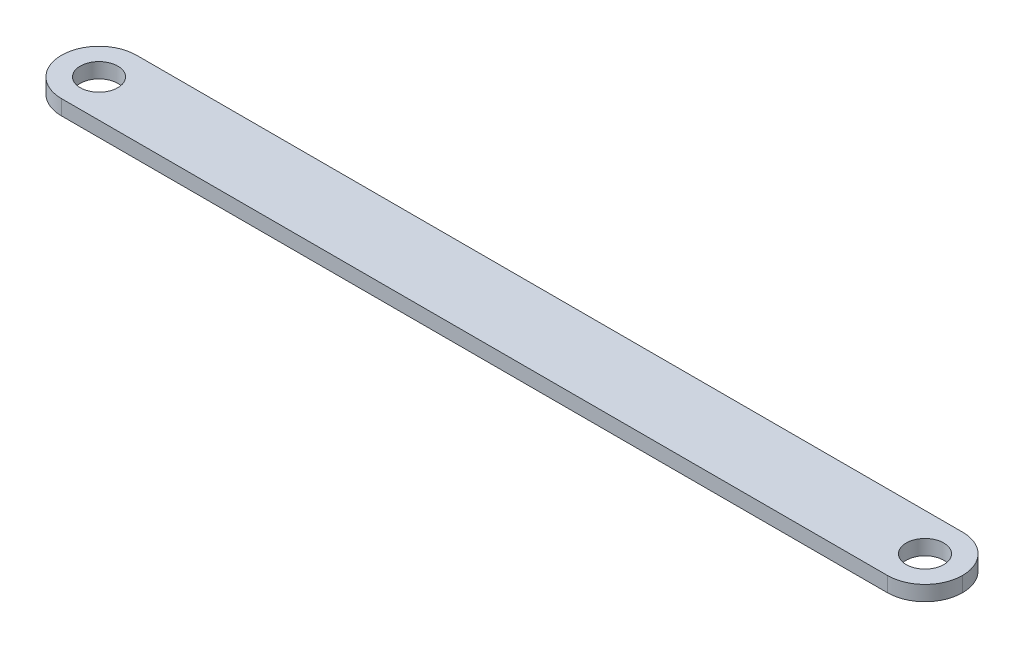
ISO-10303-21;
HEADER;
FILE_DESCRIPTION(('STEP AP214'),'2;1');
FILE_NAME('part.step','',(''),(''),'','','');
FILE_SCHEMA(('AUTOMOTIVE_DESIGN { 1 0 10303 214 1 1 1 1 }'));
ENDSEC;
DATA;
#1=APPLICATION_CONTEXT('core data for automotive mechanical design processes');
#2=APPLICATION_PROTOCOL_DEFINITION('international standard','automotive_design',2000,#1);
#3=PRODUCT_CONTEXT('',#1,'mechanical');
#4=PRODUCT('Part','Part','',(#3));
#5=PRODUCT_RELATED_PRODUCT_CATEGORY('part','',(#4));
#6=PRODUCT_DEFINITION_FORMATION('','',#4);
#7=PRODUCT_DEFINITION_CONTEXT('part definition',#1,'design');
#8=PRODUCT_DEFINITION('design','',#6,#7);
#9=PRODUCT_DEFINITION_SHAPE('','',#8);
#10=(LENGTH_UNIT() NAMED_UNIT(*) SI_UNIT(.MILLI.,.METRE.));
#11=(NAMED_UNIT(*) PLANE_ANGLE_UNIT() SI_UNIT($,.RADIAN.));
#12=(NAMED_UNIT(*) SI_UNIT($,.STERADIAN.) SOLID_ANGLE_UNIT());
#13=UNCERTAINTY_MEASURE_WITH_UNIT(LENGTH_MEASURE(1.E-05),#10,'distance_accuracy_value','');
#14=(GEOMETRIC_REPRESENTATION_CONTEXT(3) GLOBAL_UNCERTAINTY_ASSIGNED_CONTEXT((#13)) GLOBAL_UNIT_ASSIGNED_CONTEXT((#10,
#11,#12)) REPRESENTATION_CONTEXT('',''));
#15=CARTESIAN_POINT('',(0.,0.,0.));
#16=DIRECTION('',(0.,0.,1.));
#17=DIRECTION('',(1.,0.,0.));
#18=AXIS2_PLACEMENT_3D('',#15,#16,#17);
#19=CARTESIAN_POINT('',(0.,2.54,12.7));
#20=DIRECTION('',(0.,0.,-1.));
#21=DIRECTION('',(-1.,0.,0.));
#22=AXIS2_PLACEMENT_3D('',#19,#20,#21);
#23=PLANE('',#22);
#24=DIRECTION('',(1.,0.,0.));
#25=VECTOR('',#24,1.);
#26=CARTESIAN_POINT('',(0.,2.54,12.7));
#27=LINE('',#26,#25);
#28=CARTESIAN_POINT('',(6.35,2.54,12.7));
#29=VERTEX_POINT('',#28);
#30=CARTESIAN_POINT('',(146.05,2.54,12.7));
#31=VERTEX_POINT('',#30);
#32=EDGE_CURVE('E106',#29,#31,#27,.T.);
#33=ORIENTED_EDGE('',*,*,#32,.F.);
#34=DIRECTION('',(0.,-1.,0.));
#35=VECTOR('',#34,1.);
#36=CARTESIAN_POINT('',(6.35,2.54,12.7));
#37=LINE('',#36,#35);
#38=CARTESIAN_POINT('',(6.35,0.,12.7));
#39=VERTEX_POINT('',#38);
#40=EDGE_CURVE('E91',#29,#39,#37,.T.);
#41=ORIENTED_EDGE('',*,*,#40,.T.);
#42=DIRECTION('',(1.,0.,0.));
#43=VECTOR('',#42,1.);
#44=CARTESIAN_POINT('',(0.,0.,12.7));
#45=LINE('',#44,#43);
#46=CARTESIAN_POINT('',(146.05,0.,12.7));
#47=VERTEX_POINT('',#46);
#48=EDGE_CURVE('E103',#39,#47,#45,.T.);
#49=ORIENTED_EDGE('',*,*,#48,.T.);
#50=DIRECTION('',(0.,-1.,0.));
#51=VECTOR('',#50,1.);
#52=CARTESIAN_POINT('',(146.05,2.54,12.7));
#53=LINE('',#52,#51);
#54=EDGE_CURVE('E108',#47,#31,#53,.F.);
#55=ORIENTED_EDGE('',*,*,#54,.T.);
#56=EDGE_LOOP('',(#33,#41,#49,#55));
#57=FACE_BOUND('',#56,.T.);
#58=ADVANCED_FACE('F33',(#57),#23,.F.);
#59=CARTESIAN_POINT('',(0.,2.54,0.));
#60=DIRECTION('',(0.,0.,1.));
#61=DIRECTION('',(1.,0.,0.));
#62=AXIS2_PLACEMENT_3D('',#59,#60,#61);
#63=PLANE('',#62);
#64=DIRECTION('',(-1.,0.,0.));
#65=VECTOR('',#64,1.);
#66=CARTESIAN_POINT('',(0.,0.,0.));
#67=LINE('',#66,#65);
#68=CARTESIAN_POINT('',(146.05,0.,0.));
#69=VERTEX_POINT('',#68);
#70=CARTESIAN_POINT('',(6.35,0.,0.));
#71=VERTEX_POINT('',#70);
#72=EDGE_CURVE('E112',#69,#71,#67,.T.);
#73=ORIENTED_EDGE('',*,*,#72,.T.);
#74=DIRECTION('',(0.,-1.,0.));
#75=VECTOR('',#74,1.);
#76=CARTESIAN_POINT('',(6.35,2.54,0.));
#77=LINE('',#76,#75);
#78=CARTESIAN_POINT('',(6.35,2.54,0.));
#79=VERTEX_POINT('',#78);
#80=EDGE_CURVE('E11',#71,#79,#77,.F.);
#81=ORIENTED_EDGE('',*,*,#80,.T.);
#82=DIRECTION('',(-1.,0.,0.));
#83=VECTOR('',#82,1.);
#84=CARTESIAN_POINT('',(0.,2.54,0.));
#85=LINE('',#84,#83);
#86=CARTESIAN_POINT('',(146.05,2.54,0.));
#87=VERTEX_POINT('',#86);
#88=EDGE_CURVE('E116',#87,#79,#85,.T.);
#89=ORIENTED_EDGE('',*,*,#88,.F.);
#90=DIRECTION('',(0.,-1.,0.));
#91=VECTOR('',#90,1.);
#92=CARTESIAN_POINT('',(146.05,2.54,0.));
#93=LINE('',#92,#91);
#94=EDGE_CURVE('E42',#87,#69,#93,.T.);
#95=ORIENTED_EDGE('',*,*,#94,.T.);
#96=EDGE_LOOP('',(#73,#81,#89,#95));
#97=FACE_BOUND('',#96,.T.);
#98=ADVANCED_FACE('F133',(#97),#63,.F.);
#99=CARTESIAN_POINT('',(0.,2.54,0.));
#100=DIRECTION('',(0.,1.,0.));
#101=DIRECTION('',(0.,0.,1.));
#102=AXIS2_PLACEMENT_3D('',#99,#100,#101);
#103=PLANE('',#102);
#104=CARTESIAN_POINT('',(146.05,2.54,6.35));
#105=DIRECTION('',(0.,1.,0.));
#106=DIRECTION('',(0.,0.,1.));
#107=AXIS2_PLACEMENT_3D('',#104,#105,#106);
#108=CIRCLE('',#107,3.175);
#109=CARTESIAN_POINT('',(146.05,2.54,9.525));
#110=VERTEX_POINT('',#109);
#111=EDGE_CURVE('E147',#110,#110,#108,.T.);
#112=ORIENTED_EDGE('',*,*,#111,.F.);
#113=EDGE_LOOP('',(#112));
#114=FACE_BOUND('',#113,.T.);
#115=CARTESIAN_POINT('',(6.35,2.54,6.35));
#116=DIRECTION('',(0.,1.,0.));
#117=DIRECTION('',(0.,0.,1.));
#118=AXIS2_PLACEMENT_3D('',#115,#116,#117);
#119=CIRCLE('',#118,3.175);
#120=CARTESIAN_POINT('',(6.35,2.54,9.525));
#121=VERTEX_POINT('',#120);
#122=EDGE_CURVE('E141',#121,#121,#119,.T.);
#123=ORIENTED_EDGE('',*,*,#122,.F.);
#124=EDGE_LOOP('',(#123));
#125=FACE_BOUND('',#124,.T.);
#126=CARTESIAN_POINT('',(6.35,2.54,6.35));
#127=DIRECTION('',(0.,1.,0.));
#128=DIRECTION('',(0.,0.,1.));
#129=AXIS2_PLACEMENT_3D('',#126,#127,#128);
#130=CIRCLE('',#129,6.35);
#131=CARTESIAN_POINT('',(0.,2.54,6.35));
#132=VERTEX_POINT('',#131);
#133=EDGE_CURVE('E126',#79,#132,#130,.T.);
#134=ORIENTED_EDGE('',*,*,#133,.T.);
#135=CARTESIAN_POINT('',(6.35,2.54,6.35));
#136=DIRECTION('',(0.,1.,0.));
#137=DIRECTION('',(0.,0.,1.));
#138=AXIS2_PLACEMENT_3D('',#135,#136,#137);
#139=CIRCLE('',#138,6.35);
#140=EDGE_CURVE('E128',#132,#29,#139,.T.);
#141=ORIENTED_EDGE('',*,*,#140,.T.);
#142=ORIENTED_EDGE('',*,*,#32,.T.);
#143=CARTESIAN_POINT('',(146.05,2.54,6.35));
#144=DIRECTION('',(0.,1.,0.));
#145=DIRECTION('',(0.,0.,1.));
#146=AXIS2_PLACEMENT_3D('',#143,#144,#145);
#147=CIRCLE('',#146,6.35);
#148=CARTESIAN_POINT('',(152.4,2.54,6.35));
#149=VERTEX_POINT('',#148);
#150=EDGE_CURVE('E97',#31,#149,#147,.T.);
#151=ORIENTED_EDGE('',*,*,#150,.T.);
#152=CARTESIAN_POINT('',(146.05,2.54,6.35));
#153=DIRECTION('',(0.,1.,0.));
#154=DIRECTION('',(0.,0.,1.));
#155=AXIS2_PLACEMENT_3D('',#152,#153,#154);
#156=CIRCLE('',#155,6.35);
#157=EDGE_CURVE('E55',#149,#87,#156,.T.);
#158=ORIENTED_EDGE('',*,*,#157,.T.);
#159=ORIENTED_EDGE('',*,*,#88,.T.);
#160=EDGE_LOOP('',(#134,#141,#142,#151,#158,#159));
#161=FACE_BOUND('',#160,.T.);
#162=ADVANCED_FACE('F138',(#114,#125,#161),#103,.T.);
#163=CARTESIAN_POINT('',(0.,0.,0.));
#164=DIRECTION('',(0.,1.,0.));
#165=DIRECTION('',(0.,0.,1.));
#166=AXIS2_PLACEMENT_3D('',#163,#164,#165);
#167=PLANE('',#166);
#168=CARTESIAN_POINT('',(146.05,0.,6.35));
#169=DIRECTION('',(0.,1.,0.));
#170=DIRECTION('',(0.,0.,1.));
#171=AXIS2_PLACEMENT_3D('',#168,#169,#170);
#172=CIRCLE('',#171,3.175);
#173=CARTESIAN_POINT('',(146.05,0.,9.525));
#174=VERTEX_POINT('',#173);
#175=EDGE_CURVE('E150',#174,#174,#172,.T.);
#176=ORIENTED_EDGE('',*,*,#175,.T.);
#177=EDGE_LOOP('',(#176));
#178=FACE_BOUND('',#177,.T.);
#179=CARTESIAN_POINT('',(6.35,0.,6.35));
#180=DIRECTION('',(0.,1.,0.));
#181=DIRECTION('',(0.,0.,1.));
#182=AXIS2_PLACEMENT_3D('',#179,#180,#181);
#183=CIRCLE('',#182,3.175);
#184=CARTESIAN_POINT('',(6.35,0.,9.525));
#185=VERTEX_POINT('',#184);
#186=EDGE_CURVE('E144',#185,#185,#183,.T.);
#187=ORIENTED_EDGE('',*,*,#186,.T.);
#188=EDGE_LOOP('',(#187));
#189=FACE_BOUND('',#188,.T.);
#190=ORIENTED_EDGE('',*,*,#48,.F.);
#191=CARTESIAN_POINT('',(6.35,0.,6.35));
#192=DIRECTION('',(0.,1.,0.));
#193=DIRECTION('',(0.,0.,1.));
#194=AXIS2_PLACEMENT_3D('',#191,#192,#193);
#195=CIRCLE('',#194,6.35);
#196=CARTESIAN_POINT('',(0.,0.,6.35));
#197=VERTEX_POINT('',#196);
#198=EDGE_CURVE('E87',#39,#197,#195,.F.);
#199=ORIENTED_EDGE('',*,*,#198,.T.);
#200=CARTESIAN_POINT('',(6.35,0.,6.35));
#201=DIRECTION('',(0.,1.,0.));
#202=DIRECTION('',(0.,0.,1.));
#203=AXIS2_PLACEMENT_3D('',#200,#201,#202);
#204=CIRCLE('',#203,6.35);
#205=EDGE_CURVE('E98',#197,#71,#204,.F.);
#206=ORIENTED_EDGE('',*,*,#205,.T.);
#207=ORIENTED_EDGE('',*,*,#72,.F.);
#208=CARTESIAN_POINT('',(146.05,0.,6.35));
#209=DIRECTION('',(0.,1.,0.));
#210=DIRECTION('',(0.,0.,1.));
#211=AXIS2_PLACEMENT_3D('',#208,#209,#210);
#212=CIRCLE('',#211,6.35);
#213=CARTESIAN_POINT('',(152.4,0.,6.35));
#214=VERTEX_POINT('',#213);
#215=EDGE_CURVE('E121',#69,#214,#212,.F.);
#216=ORIENTED_EDGE('',*,*,#215,.T.);
#217=CARTESIAN_POINT('',(146.05,0.,6.35));
#218=DIRECTION('',(0.,1.,0.));
#219=DIRECTION('',(0.,0.,1.));
#220=AXIS2_PLACEMENT_3D('',#217,#218,#219);
#221=CIRCLE('',#220,6.35);
#222=EDGE_CURVE('E107',#214,#47,#221,.F.);
#223=ORIENTED_EDGE('',*,*,#222,.T.);
#224=EDGE_LOOP('',(#190,#199,#206,#207,#216,#223));
#225=FACE_BOUND('',#224,.T.);
#226=ADVANCED_FACE('F110',(#178,#189,#225),#167,.F.);
#227=CARTESIAN_POINT('',(6.35,2.54,6.35));
#228=DIRECTION('',(0.,-1.,0.));
#229=DIRECTION('',(0.,0.,-1.));
#230=AXIS2_PLACEMENT_3D('',#227,#228,#229);
#231=CYLINDRICAL_SURFACE('',#230,6.35);
#232=DIRECTION('',(0.,-1.,0.));
#233=VECTOR('',#232,1.);
#234=CARTESIAN_POINT('',(0.,2.54,6.35));
#235=LINE('',#234,#233);
#236=EDGE_CURVE('E93',#132,#197,#235,.T.);
#237=ORIENTED_EDGE('',*,*,#236,.F.);
#238=ORIENTED_EDGE('',*,*,#133,.F.);
#239=ORIENTED_EDGE('',*,*,#80,.F.);
#240=ORIENTED_EDGE('',*,*,#205,.F.);
#241=EDGE_LOOP('',(#237,#238,#239,#240));
#242=FACE_BOUND('',#241,.T.);
#243=ADVANCED_FACE('F136',(#242),#231,.T.);
#244=CARTESIAN_POINT('',(6.35,2.54,6.35));
#245=DIRECTION('',(0.,-1.,0.));
#246=DIRECTION('',(0.,0.,-1.));
#247=AXIS2_PLACEMENT_3D('',#244,#245,#246);
#248=CYLINDRICAL_SURFACE('',#247,6.35);
#249=ORIENTED_EDGE('',*,*,#140,.F.);
#250=ORIENTED_EDGE('',*,*,#236,.T.);
#251=ORIENTED_EDGE('',*,*,#198,.F.);
#252=ORIENTED_EDGE('',*,*,#40,.F.);
#253=EDGE_LOOP('',(#249,#250,#251,#252));
#254=FACE_BOUND('',#253,.T.);
#255=ADVANCED_FACE('F90',(#254),#248,.T.);
#256=CARTESIAN_POINT('',(146.05,2.54,6.35));
#257=DIRECTION('',(0.,-1.,0.));
#258=DIRECTION('',(0.,0.,-1.));
#259=AXIS2_PLACEMENT_3D('',#256,#257,#258);
#260=CYLINDRICAL_SURFACE('',#259,6.35);
#261=DIRECTION('',(0.,-1.,0.));
#262=VECTOR('',#261,1.);
#263=CARTESIAN_POINT('',(152.4,2.54,6.35));
#264=LINE('',#263,#262);
#265=EDGE_CURVE('E37',#149,#214,#264,.T.);
#266=ORIENTED_EDGE('',*,*,#265,.F.);
#267=ORIENTED_EDGE('',*,*,#150,.F.);
#268=ORIENTED_EDGE('',*,*,#54,.F.);
#269=ORIENTED_EDGE('',*,*,#222,.F.);
#270=EDGE_LOOP('',(#266,#267,#268,#269));
#271=FACE_BOUND('',#270,.T.);
#272=ADVANCED_FACE('F35',(#271),#260,.T.);
#273=CARTESIAN_POINT('',(146.05,2.54,6.35));
#274=DIRECTION('',(0.,-1.,0.));
#275=DIRECTION('',(0.,0.,-1.));
#276=AXIS2_PLACEMENT_3D('',#273,#274,#275);
#277=CYLINDRICAL_SURFACE('',#276,6.35);
#278=ORIENTED_EDGE('',*,*,#157,.F.);
#279=ORIENTED_EDGE('',*,*,#265,.T.);
#280=ORIENTED_EDGE('',*,*,#215,.F.);
#281=ORIENTED_EDGE('',*,*,#94,.F.);
#282=EDGE_LOOP('',(#278,#279,#280,#281));
#283=FACE_BOUND('',#282,.T.);
#284=ADVANCED_FACE('F156',(#283),#277,.T.);
#285=CARTESIAN_POINT('',(6.35,0.,6.35));
#286=DIRECTION('',(0.,1.,0.));
#287=DIRECTION('',(0.,0.,1.));
#288=AXIS2_PLACEMENT_3D('',#285,#286,#287);
#289=CYLINDRICAL_SURFACE('',#288,3.175);
#290=ORIENTED_EDGE('',*,*,#186,.F.);
#291=EDGE_LOOP('',(#290));
#292=FACE_BOUND('',#291,.T.);
#293=ORIENTED_EDGE('',*,*,#122,.T.);
#294=EDGE_LOOP('',(#293));
#295=FACE_BOUND('',#294,.T.);
#296=ADVANCED_FACE('F163',(#292,#295),#289,.F.);
#297=CARTESIAN_POINT('',(146.05,0.,6.35));
#298=DIRECTION('',(0.,1.,0.));
#299=DIRECTION('',(0.,0.,1.));
#300=AXIS2_PLACEMENT_3D('',#297,#298,#299);
#301=CYLINDRICAL_SURFACE('',#300,3.175);
#302=ORIENTED_EDGE('',*,*,#175,.F.);
#303=EDGE_LOOP('',(#302));
#304=FACE_BOUND('',#303,.T.);
#305=ORIENTED_EDGE('',*,*,#111,.T.);
#306=EDGE_LOOP('',(#305));
#307=FACE_BOUND('',#306,.T.);
#308=ADVANCED_FACE('F186',(#304,#307),#301,.F.);
#309=CLOSED_SHELL('',(#58,#98,#162,#226,#243,#255,#272,#284,#296,#308));
#310=MANIFOLD_SOLID_BREP('B2',#309);
#311=ADVANCED_BREP_SHAPE_REPRESENTATION('',(#18,#310),#14);
#312=SHAPE_DEFINITION_REPRESENTATION(#9,#311);
ENDSEC;
END-ISO-10303-21;
